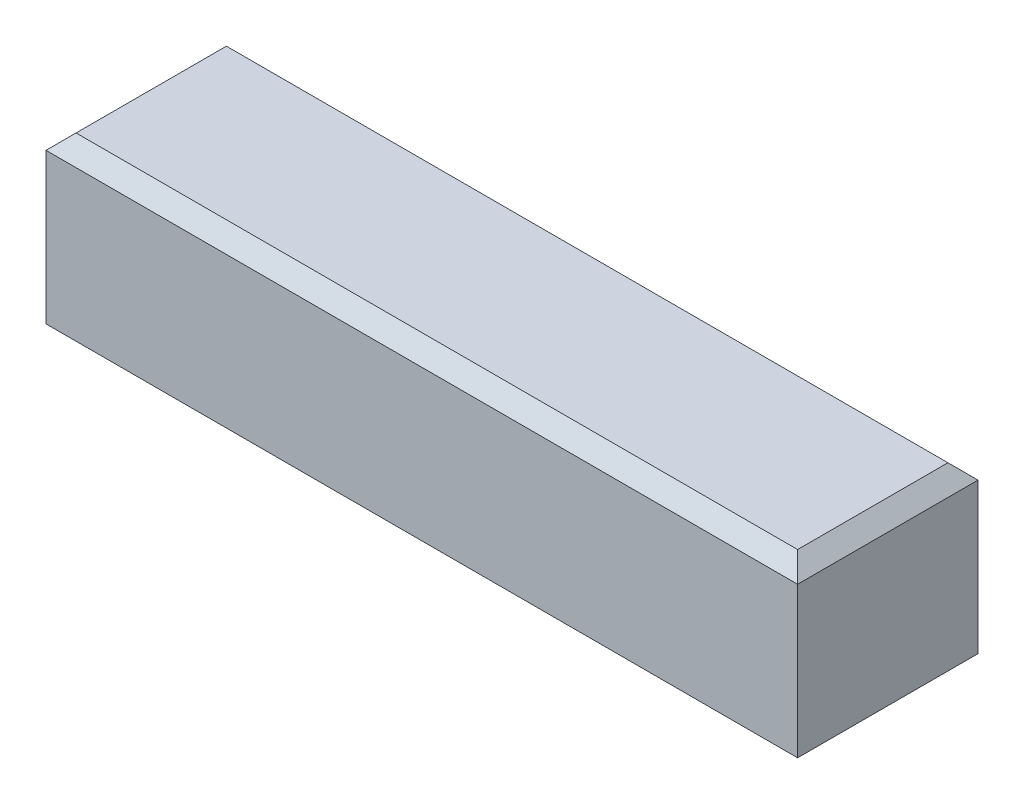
from build123d import *

# Parameters (mm, degrees)
ESQUISSE1_W          = 25
ESQUISSE1_H          = 6
BASE_EXTRUSION_DEPTH = 6
CHANFREIN1_SIZE      = 0.5


with BuildPart() as part:
    # Esquisse1 → Base-Extrusion (new body)
    with BuildSketch(Plane.XY):
        Rectangle(ESQUISSE1_W, ESQUISSE1_H)
    extrude(amount=BASE_EXTRUSION_DEPTH)

    # Chanfrein1
    chanfrein1_edges = [part.edges().sort_by_distance(p)[0] for p in [
        (-12.5, 3, 3),
        (12.5, 3, 3),
        (0, 3, 0),
        (0, 3, 6),
        (12.5, -3, 3),
        (-12.5, -3, 3),
        (0, -3, 0),
        (0, -3, 6),
    ]]
    chamfer(chanfrein1_edges, length=CHANFREIN1_SIZE)


solid = part.part
